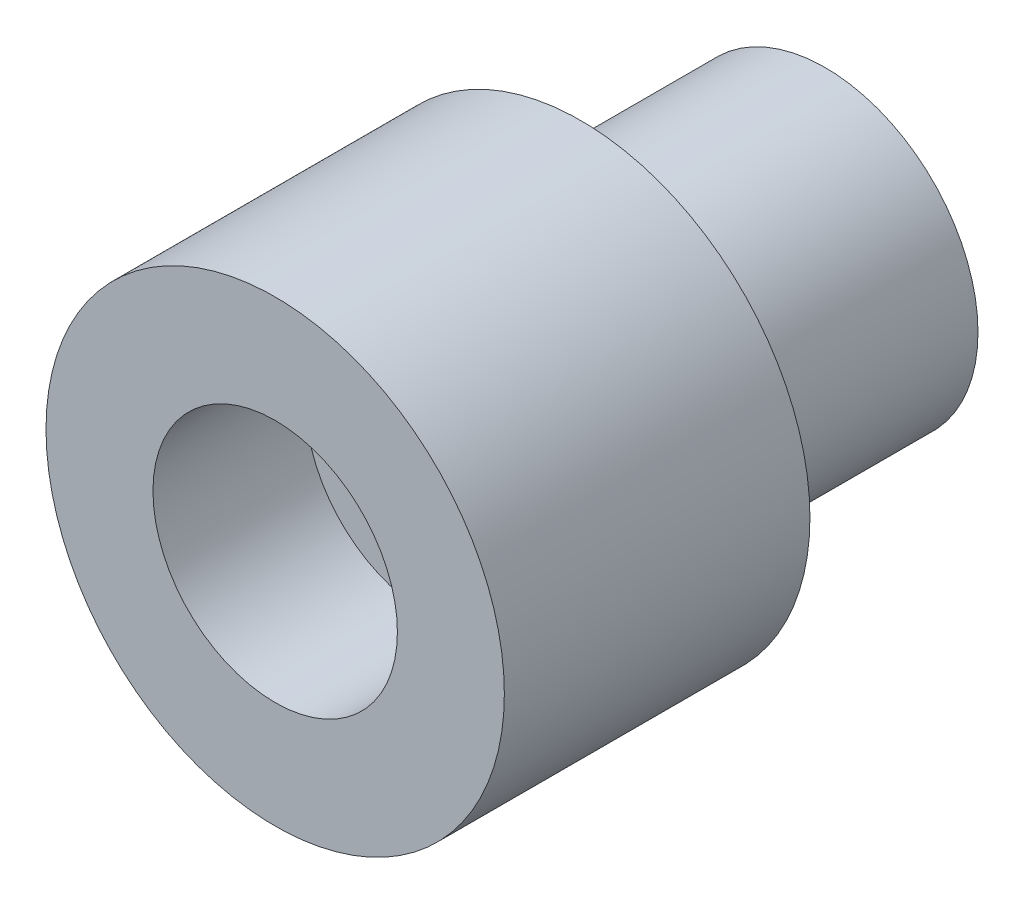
ISO-10303-21;
HEADER;
FILE_DESCRIPTION(('STEP AP214'),'2;1');
FILE_NAME('part.step','',(''),(''),'','','');
FILE_SCHEMA(('AUTOMOTIVE_DESIGN { 1 0 10303 214 1 1 1 1 }'));
ENDSEC;
DATA;
#1=APPLICATION_CONTEXT('core data for automotive mechanical design processes');
#2=APPLICATION_PROTOCOL_DEFINITION('international standard','automotive_design',2000,#1);
#3=PRODUCT_CONTEXT('',#1,'mechanical');
#4=PRODUCT('Part','Part','',(#3));
#5=PRODUCT_RELATED_PRODUCT_CATEGORY('part','',(#4));
#6=PRODUCT_DEFINITION_FORMATION('','',#4);
#7=PRODUCT_DEFINITION_CONTEXT('part definition',#1,'design');
#8=PRODUCT_DEFINITION('design','',#6,#7);
#9=PRODUCT_DEFINITION_SHAPE('','',#8);
#10=(LENGTH_UNIT() NAMED_UNIT(*) SI_UNIT(.MILLI.,.METRE.));
#11=(NAMED_UNIT(*) PLANE_ANGLE_UNIT() SI_UNIT($,.RADIAN.));
#12=(NAMED_UNIT(*) SI_UNIT($,.STERADIAN.) SOLID_ANGLE_UNIT());
#13=UNCERTAINTY_MEASURE_WITH_UNIT(LENGTH_MEASURE(1.E-05),#10,'distance_accuracy_value','');
#14=(GEOMETRIC_REPRESENTATION_CONTEXT(3) GLOBAL_UNCERTAINTY_ASSIGNED_CONTEXT((#13)) GLOBAL_UNIT_ASSIGNED_CONTEXT((#10,
#11,#12)) REPRESENTATION_CONTEXT('',''));
#15=CARTESIAN_POINT('',(0.,0.,0.));
#16=DIRECTION('',(0.,0.,1.));
#17=DIRECTION('',(1.,0.,0.));
#18=AXIS2_PLACEMENT_3D('',#15,#16,#17);
#19=CARTESIAN_POINT('',(7.5,0.,10.));
#20=DIRECTION('',(0.,0.,-1.));
#21=DIRECTION('',(-1.,0.,0.));
#22=AXIS2_PLACEMENT_3D('',#19,#20,#21);
#23=PLANE('',#22);
#24=CARTESIAN_POINT('',(0.,0.,10.));
#25=DIRECTION('',(0.,0.,1.));
#26=DIRECTION('',(1.,0.,0.));
#27=AXIS2_PLACEMENT_3D('',#24,#25,#26);
#28=CIRCLE('',#27,4.);
#29=CARTESIAN_POINT('',(4.,0.,10.));
#30=VERTEX_POINT('',#29);
#31=EDGE_CURVE('E8',#30,#30,#28,.T.);
#32=ORIENTED_EDGE('',*,*,#31,.F.);
#33=EDGE_LOOP('',(#32));
#34=FACE_BOUND('',#33,.T.);
#35=CARTESIAN_POINT('',(0.,0.,10.));
#36=DIRECTION('',(0.,0.,1.));
#37=DIRECTION('',(1.,0.,0.));
#38=AXIS2_PLACEMENT_3D('',#35,#36,#37);
#39=CIRCLE('',#38,7.5);
#40=CARTESIAN_POINT('',(7.5,0.,10.));
#41=VERTEX_POINT('',#40);
#42=EDGE_CURVE('E40',#41,#41,#39,.T.);
#43=ORIENTED_EDGE('',*,*,#42,.T.);
#44=EDGE_LOOP('',(#43));
#45=FACE_BOUND('',#44,.T.);
#46=ADVANCED_FACE('F12',(#34,#45),#23,.F.);
#47=CARTESIAN_POINT('',(0.,0.,22.));
#48=DIRECTION('',(0.,0.,1.));
#49=DIRECTION('',(1.,0.,0.));
#50=AXIS2_PLACEMENT_3D('',#47,#48,#49);
#51=CYLINDRICAL_SURFACE('',#50,4.);
#52=CARTESIAN_POINT('',(0.,0.,5.));
#53=DIRECTION('',(0.,0.,1.));
#54=DIRECTION('',(1.,0.,0.));
#55=AXIS2_PLACEMENT_3D('',#52,#53,#54);
#56=CIRCLE('',#55,4.);
#57=CARTESIAN_POINT('',(4.,0.,5.));
#58=VERTEX_POINT('',#57);
#59=EDGE_CURVE('E18',#58,#58,#56,.T.);
#60=ORIENTED_EDGE('',*,*,#59,.F.);
#61=EDGE_LOOP('',(#60));
#62=FACE_BOUND('',#61,.T.);
#63=ORIENTED_EDGE('',*,*,#31,.T.);
#64=EDGE_LOOP('',(#63));
#65=FACE_BOUND('',#64,.T.);
#66=ADVANCED_FACE('F77',(#62,#65),#51,.F.);
#67=CARTESIAN_POINT('',(4.,0.,5.));
#68=DIRECTION('',(0.,0.,-1.));
#69=DIRECTION('',(-1.,0.,0.));
#70=AXIS2_PLACEMENT_3D('',#67,#68,#69);
#71=PLANE('',#70);
#72=CARTESIAN_POINT('',(0.,0.,5.));
#73=DIRECTION('',(0.,0.,1.));
#74=DIRECTION('',(1.,0.,0.));
#75=AXIS2_PLACEMENT_3D('',#72,#73,#74);
#76=CIRCLE('',#75,2.25);
#77=CARTESIAN_POINT('',(2.25,0.,5.));
#78=VERTEX_POINT('',#77);
#79=EDGE_CURVE('E22',#78,#78,#76,.T.);
#80=ORIENTED_EDGE('',*,*,#79,.F.);
#81=EDGE_LOOP('',(#80));
#82=FACE_BOUND('',#81,.T.);
#83=ORIENTED_EDGE('',*,*,#59,.T.);
#84=EDGE_LOOP('',(#83));
#85=FACE_BOUND('',#84,.T.);
#86=ADVANCED_FACE('F72',(#82,#85),#71,.F.);
#87=CARTESIAN_POINT('',(0.,0.,22.));
#88=DIRECTION('',(0.,0.,1.));
#89=DIRECTION('',(1.,0.,0.));
#90=AXIS2_PLACEMENT_3D('',#87,#88,#89);
#91=CYLINDRICAL_SURFACE('',#90,2.25);
#92=CARTESIAN_POINT('',(0.,0.,-8.));
#93=DIRECTION('',(0.,0.,1.));
#94=DIRECTION('',(1.,0.,0.));
#95=AXIS2_PLACEMENT_3D('',#92,#93,#94);
#96=CIRCLE('',#95,2.25);
#97=CARTESIAN_POINT('',(2.25,0.,-8.));
#98=VERTEX_POINT('',#97);
#99=EDGE_CURVE('E26',#98,#98,#96,.T.);
#100=ORIENTED_EDGE('',*,*,#99,.F.);
#101=EDGE_LOOP('',(#100));
#102=FACE_BOUND('',#101,.T.);
#103=ORIENTED_EDGE('',*,*,#79,.T.);
#104=EDGE_LOOP('',(#103));
#105=FACE_BOUND('',#104,.T.);
#106=ADVANCED_FACE('F66',(#102,#105),#91,.F.);
#107=CARTESIAN_POINT('',(2.25,0.,-8.));
#108=DIRECTION('',(0.,0.,1.));
#109=DIRECTION('',(1.,0.,0.));
#110=AXIS2_PLACEMENT_3D('',#107,#108,#109);
#111=PLANE('',#110);
#112=CARTESIAN_POINT('',(0.,0.,-8.));
#113=DIRECTION('',(0.,0.,1.));
#114=DIRECTION('',(1.,0.,0.));
#115=AXIS2_PLACEMENT_3D('',#112,#113,#114);
#116=CIRCLE('',#115,5.);
#117=CARTESIAN_POINT('',(5.,0.,-8.));
#118=VERTEX_POINT('',#117);
#119=EDGE_CURVE('E31',#118,#118,#116,.T.);
#120=ORIENTED_EDGE('',*,*,#119,.F.);
#121=EDGE_LOOP('',(#120));
#122=FACE_BOUND('',#121,.T.);
#123=ORIENTED_EDGE('',*,*,#99,.T.);
#124=EDGE_LOOP('',(#123));
#125=FACE_BOUND('',#124,.T.);
#126=ADVANCED_FACE('F60',(#122,#125),#111,.F.);
#127=CARTESIAN_POINT('',(0.,0.,22.));
#128=DIRECTION('',(0.,0.,1.));
#129=DIRECTION('',(1.,0.,0.));
#130=AXIS2_PLACEMENT_3D('',#127,#128,#129);
#131=CYLINDRICAL_SURFACE('',#130,5.);
#132=CARTESIAN_POINT('',(0.,0.,0.));
#133=DIRECTION('',(0.,0.,1.));
#134=DIRECTION('',(1.,0.,0.));
#135=AXIS2_PLACEMENT_3D('',#132,#133,#134);
#136=CIRCLE('',#135,5.);
#137=CARTESIAN_POINT('',(5.,0.,0.));
#138=VERTEX_POINT('',#137);
#139=EDGE_CURVE('E34',#138,#138,#136,.T.);
#140=ORIENTED_EDGE('',*,*,#139,.F.);
#141=EDGE_LOOP('',(#140));
#142=FACE_BOUND('',#141,.T.);
#143=ORIENTED_EDGE('',*,*,#119,.T.);
#144=EDGE_LOOP('',(#143));
#145=FACE_BOUND('',#144,.T.);
#146=ADVANCED_FACE('F54',(#142,#145),#131,.T.);
#147=CARTESIAN_POINT('',(5.,0.,0.));
#148=DIRECTION('',(0.,0.,1.));
#149=DIRECTION('',(1.,0.,0.));
#150=AXIS2_PLACEMENT_3D('',#147,#148,#149);
#151=PLANE('',#150);
#152=CARTESIAN_POINT('',(0.,0.,0.));
#153=DIRECTION('',(0.,0.,1.));
#154=DIRECTION('',(1.,0.,0.));
#155=AXIS2_PLACEMENT_3D('',#152,#153,#154);
#156=CIRCLE('',#155,7.5);
#157=CARTESIAN_POINT('',(7.5,0.,0.));
#158=VERTEX_POINT('',#157);
#159=EDGE_CURVE('E37',#158,#158,#156,.T.);
#160=ORIENTED_EDGE('',*,*,#159,.F.);
#161=EDGE_LOOP('',(#160));
#162=FACE_BOUND('',#161,.T.);
#163=ORIENTED_EDGE('',*,*,#139,.T.);
#164=EDGE_LOOP('',(#163));
#165=FACE_BOUND('',#164,.T.);
#166=ADVANCED_FACE('F48',(#162,#165),#151,.F.);
#167=CARTESIAN_POINT('',(0.,0.,22.));
#168=DIRECTION('',(0.,0.,1.));
#169=DIRECTION('',(1.,0.,0.));
#170=AXIS2_PLACEMENT_3D('',#167,#168,#169);
#171=CYLINDRICAL_SURFACE('',#170,7.5);
#172=ORIENTED_EDGE('',*,*,#42,.F.);
#173=EDGE_LOOP('',(#172));
#174=FACE_BOUND('',#173,.T.);
#175=ORIENTED_EDGE('',*,*,#159,.T.);
#176=EDGE_LOOP('',(#175));
#177=FACE_BOUND('',#176,.T.);
#178=ADVANCED_FACE('F45',(#174,#177),#171,.T.);
#179=CLOSED_SHELL('',(#46,#66,#86,#106,#126,#146,#166,#178));
#180=MANIFOLD_SOLID_BREP('B1',#179);
#181=ADVANCED_BREP_SHAPE_REPRESENTATION('',(#18,#180),#14);
#182=SHAPE_DEFINITION_REPRESENTATION(#9,#181);
ENDSEC;
END-ISO-10303-21;
